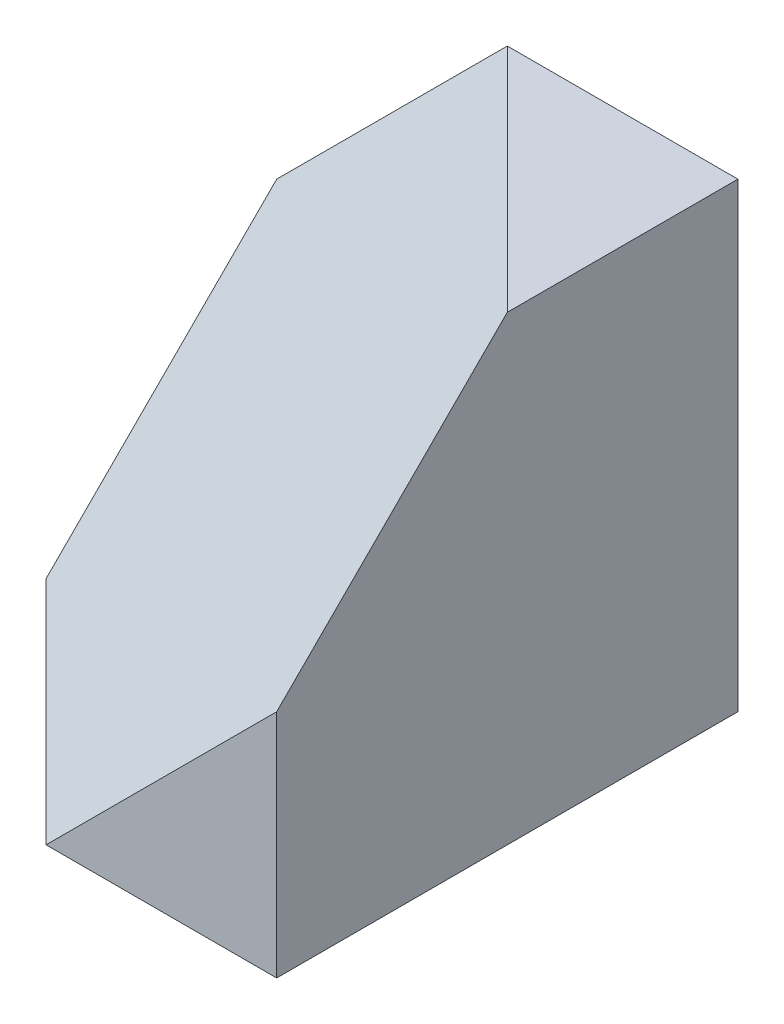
ISO-10303-21;
HEADER;
FILE_DESCRIPTION(('STEP AP214'),'2;1');
FILE_NAME('part.step','',(''),(''),'','','');
FILE_SCHEMA(('AUTOMOTIVE_DESIGN { 1 0 10303 214 1 1 1 1 }'));
ENDSEC;
DATA;
#1=APPLICATION_CONTEXT('core data for automotive mechanical design processes');
#2=APPLICATION_PROTOCOL_DEFINITION('international standard','automotive_design',2000,#1);
#3=PRODUCT_CONTEXT('',#1,'mechanical');
#4=PRODUCT('Part','Part','',(#3));
#5=PRODUCT_RELATED_PRODUCT_CATEGORY('part','',(#4));
#6=PRODUCT_DEFINITION_FORMATION('','',#4);
#7=PRODUCT_DEFINITION_CONTEXT('part definition',#1,'design');
#8=PRODUCT_DEFINITION('design','',#6,#7);
#9=PRODUCT_DEFINITION_SHAPE('','',#8);
#10=(LENGTH_UNIT() NAMED_UNIT(*) SI_UNIT(.MILLI.,.METRE.));
#11=(NAMED_UNIT(*) PLANE_ANGLE_UNIT() SI_UNIT($,.RADIAN.));
#12=(NAMED_UNIT(*) SI_UNIT($,.STERADIAN.) SOLID_ANGLE_UNIT());
#13=UNCERTAINTY_MEASURE_WITH_UNIT(LENGTH_MEASURE(1.E-05),#10,'distance_accuracy_value','');
#14=(GEOMETRIC_REPRESENTATION_CONTEXT(3) GLOBAL_UNCERTAINTY_ASSIGNED_CONTEXT((#13)) GLOBAL_UNIT_ASSIGNED_CONTEXT((#10,
#11,#12)) REPRESENTATION_CONTEXT('',''));
#15=CARTESIAN_POINT('',(0.,0.,0.));
#16=DIRECTION('',(0.,0.,1.));
#17=DIRECTION('',(1.,0.,0.));
#18=AXIS2_PLACEMENT_3D('',#15,#16,#17);
#19=CARTESIAN_POINT('',(0.,0.,-10.));
#20=DIRECTION('',(-1.,0.,0.));
#21=DIRECTION('',(0.,0.,1.));
#22=AXIS2_PLACEMENT_3D('',#19,#20,#21);
#23=PLANE('',#22);
#24=DIRECTION('',(0.,-0.707106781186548,0.707106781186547));
#25=VECTOR('',#24,1.);
#26=CARTESIAN_POINT('',(0.,2.5,-7.5));
#27=LINE('',#26,#25);
#28=CARTESIAN_POINT('',(0.,5.,-10.));
#29=VERTEX_POINT('',#28);
#30=CARTESIAN_POINT('',(0.,0.,-5.));
#31=VERTEX_POINT('',#30);
#32=EDGE_CURVE('E118',#29,#31,#27,.T.);
#33=ORIENTED_EDGE('',*,*,#32,.F.);
#34=DIRECTION('',(0.,-1.,0.));
#35=VECTOR('',#34,1.);
#36=CARTESIAN_POINT('',(0.,0.,-10.));
#37=LINE('',#36,#35);
#38=CARTESIAN_POINT('',(0.,0.,-10.));
#39=VERTEX_POINT('',#38);
#40=EDGE_CURVE('E97',#29,#39,#37,.T.);
#41=ORIENTED_EDGE('',*,*,#40,.T.);
#42=DIRECTION('',(0.,0.,1.));
#43=VECTOR('',#42,1.);
#44=CARTESIAN_POINT('',(0.,0.,-10.));
#45=LINE('',#44,#43);
#46=EDGE_CURVE('E106',#39,#31,#45,.T.);
#47=ORIENTED_EDGE('',*,*,#46,.T.);
#48=EDGE_LOOP('',(#33,#41,#47));
#49=FACE_BOUND('',#48,.T.);
#50=ADVANCED_FACE('F36',(#49),#23,.T.);
#51=CARTESIAN_POINT('',(0.,10.,-10.));
#52=DIRECTION('',(0.,1.,0.));
#53=DIRECTION('',(0.,0.,1.));
#54=AXIS2_PLACEMENT_3D('',#51,#52,#53);
#55=PLANE('',#54);
#56=DIRECTION('',(-0.707106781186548,0.,-0.707106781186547));
#57=VECTOR('',#56,1.);
#58=CARTESIAN_POINT('',(2.5,10.,-12.5));
#59=LINE('',#58,#57);
#60=CARTESIAN_POINT('',(10.,10.,-5.));
#61=VERTEX_POINT('',#60);
#62=CARTESIAN_POINT('',(5.,10.,-10.));
#63=VERTEX_POINT('',#62);
#64=EDGE_CURVE('E94',#61,#63,#59,.T.);
#65=ORIENTED_EDGE('',*,*,#64,.F.);
#66=DIRECTION('',(0.,0.,1.));
#67=VECTOR('',#66,1.);
#68=CARTESIAN_POINT('',(10.,10.,-10.));
#69=LINE('',#68,#67);
#70=CARTESIAN_POINT('',(10.,10.,-10.));
#71=VERTEX_POINT('',#70);
#72=EDGE_CURVE('E43',#71,#61,#69,.T.);
#73=ORIENTED_EDGE('',*,*,#72,.F.);
#74=DIRECTION('',(-1.,0.,0.));
#75=VECTOR('',#74,1.);
#76=CARTESIAN_POINT('',(0.,10.,-10.));
#77=LINE('',#76,#75);
#78=EDGE_CURVE('E108',#71,#63,#77,.T.);
#79=ORIENTED_EDGE('',*,*,#78,.T.);
#80=EDGE_LOOP('',(#65,#73,#79));
#81=FACE_BOUND('',#80,.T.);
#82=ADVANCED_FACE('F134',(#81),#55,.T.);
#83=CARTESIAN_POINT('',(10.,0.,-10.));
#84=DIRECTION('',(1.,0.,0.));
#85=DIRECTION('',(0.,1.,0.));
#86=AXIS2_PLACEMENT_3D('',#83,#84,#85);
#87=PLANE('',#86);
#88=DIRECTION('',(0.,0.707106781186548,-0.707106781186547));
#89=VECTOR('',#88,1.);
#90=CARTESIAN_POINT('',(10.,7.5,-2.5));
#91=LINE('',#90,#89);
#92=CARTESIAN_POINT('',(10.,5.,0.));
#93=VERTEX_POINT('',#92);
#94=EDGE_CURVE('E89',#93,#61,#91,.T.);
#95=ORIENTED_EDGE('',*,*,#94,.F.);
#96=DIRECTION('',(0.,1.,0.));
#97=VECTOR('',#96,1.);
#98=CARTESIAN_POINT('',(10.,0.,0.));
#99=LINE('',#98,#97);
#100=CARTESIAN_POINT('',(10.,0.,0.));
#101=VERTEX_POINT('',#100);
#102=EDGE_CURVE('E93',#101,#93,#99,.T.);
#103=ORIENTED_EDGE('',*,*,#102,.F.);
#104=DIRECTION('',(0.,0.,1.));
#105=VECTOR('',#104,1.);
#106=CARTESIAN_POINT('',(10.,0.,-10.));
#107=LINE('',#106,#105);
#108=CARTESIAN_POINT('',(10.,0.,-10.));
#109=VERTEX_POINT('',#108);
#110=EDGE_CURVE('E105',#109,#101,#107,.T.);
#111=ORIENTED_EDGE('',*,*,#110,.F.);
#112=DIRECTION('',(0.,1.,0.));
#113=VECTOR('',#112,1.);
#114=CARTESIAN_POINT('',(10.,0.,-10.));
#115=LINE('',#114,#113);
#116=EDGE_CURVE('E111',#109,#71,#115,.T.);
#117=ORIENTED_EDGE('',*,*,#116,.T.);
#118=ORIENTED_EDGE('',*,*,#72,.T.);
#119=EDGE_LOOP('',(#95,#103,#111,#117,#118));
#120=FACE_BOUND('',#119,.T.);
#121=ADVANCED_FACE('F92',(#120),#87,.T.);
#122=CARTESIAN_POINT('',(0.,0.,-10.));
#123=DIRECTION('',(0.,-1.,0.));
#124=DIRECTION('',(0.,0.,-1.));
#125=AXIS2_PLACEMENT_3D('',#122,#123,#124);
#126=PLANE('',#125);
#127=DIRECTION('',(0.707106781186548,0.,0.707106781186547));
#128=VECTOR('',#127,1.);
#129=CARTESIAN_POINT('',(-2.5,0.,-7.5));
#130=LINE('',#129,#128);
#131=CARTESIAN_POINT('',(5.,0.,0.));
#132=VERTEX_POINT('',#131);
#133=EDGE_CURVE('E50',#31,#132,#130,.T.);
#134=ORIENTED_EDGE('',*,*,#133,.F.);
#135=ORIENTED_EDGE('',*,*,#46,.F.);
#136=DIRECTION('',(1.,0.,0.));
#137=VECTOR('',#136,1.);
#138=CARTESIAN_POINT('',(0.,0.,-10.));
#139=LINE('',#138,#137);
#140=EDGE_CURVE('E99',#39,#109,#139,.T.);
#141=ORIENTED_EDGE('',*,*,#140,.T.);
#142=ORIENTED_EDGE('',*,*,#110,.T.);
#143=DIRECTION('',(1.,0.,0.));
#144=VECTOR('',#143,1.);
#145=CARTESIAN_POINT('',(0.,0.,0.));
#146=LINE('',#145,#144);
#147=EDGE_CURVE('E69',#132,#101,#146,.T.);
#148=ORIENTED_EDGE('',*,*,#147,.F.);
#149=EDGE_LOOP('',(#134,#135,#141,#142,#148));
#150=FACE_BOUND('',#149,.T.);
#151=ADVANCED_FACE('F127',(#150),#126,.T.);
#152=CARTESIAN_POINT('',(0.,0.,-10.));
#153=DIRECTION('',(0.,0.,-1.));
#154=DIRECTION('',(-1.,0.,0.));
#155=AXIS2_PLACEMENT_3D('',#152,#153,#154);
#156=PLANE('',#155);
#157=DIRECTION('',(-0.707106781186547,-0.707106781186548,0.));
#158=VECTOR('',#157,1.);
#159=CARTESIAN_POINT('',(-2.5,2.5,-10.));
#160=LINE('',#159,#158);
#161=EDGE_CURVE('E77',#63,#29,#160,.T.);
#162=ORIENTED_EDGE('',*,*,#161,.F.);
#163=ORIENTED_EDGE('',*,*,#78,.F.);
#164=ORIENTED_EDGE('',*,*,#116,.F.);
#165=ORIENTED_EDGE('',*,*,#140,.F.);
#166=ORIENTED_EDGE('',*,*,#40,.F.);
#167=EDGE_LOOP('',(#162,#163,#164,#165,#166));
#168=FACE_BOUND('',#167,.T.);
#169=ADVANCED_FACE('F123',(#168),#156,.T.);
#170=CARTESIAN_POINT('',(0.,0.,0.));
#171=DIRECTION('',(0.,0.,-1.));
#172=DIRECTION('',(-1.,0.,0.));
#173=AXIS2_PLACEMENT_3D('',#170,#171,#172);
#174=PLANE('',#173);
#175=ORIENTED_EDGE('',*,*,#102,.T.);
#176=DIRECTION('',(-0.707106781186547,-0.707106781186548,0.));
#177=VECTOR('',#176,1.);
#178=CARTESIAN_POINT('',(2.5,-2.5,0.));
#179=LINE('',#178,#177);
#180=EDGE_CURVE('E12',#93,#132,#179,.T.);
#181=ORIENTED_EDGE('',*,*,#180,.T.);
#182=ORIENTED_EDGE('',*,*,#147,.T.);
#183=EDGE_LOOP('',(#175,#181,#182));
#184=FACE_BOUND('',#183,.T.);
#185=ADVANCED_FACE('F96',(#184),#174,.F.);
#186=CARTESIAN_POINT('',(1.66666666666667,-1.66666666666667,-1.66666666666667));
#187=DIRECTION('',(0.577350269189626,-0.577350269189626,-0.577350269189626));
#188=DIRECTION('',(-0.707106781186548,0.,-0.707106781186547));
#189=AXIS2_PLACEMENT_3D('',#186,#187,#188);
#190=PLANE('',#189);
#191=ORIENTED_EDGE('',*,*,#64,.T.);
#192=ORIENTED_EDGE('',*,*,#161,.T.);
#193=ORIENTED_EDGE('',*,*,#32,.T.);
#194=ORIENTED_EDGE('',*,*,#133,.T.);
#195=ORIENTED_EDGE('',*,*,#180,.F.);
#196=ORIENTED_EDGE('',*,*,#94,.T.);
#197=EDGE_LOOP('',(#191,#192,#193,#194,#195,#196));
#198=FACE_BOUND('',#197,.T.);
#199=ADVANCED_FACE('F88',(#198),#190,.F.);
#200=CLOSED_SHELL('',(#50,#82,#121,#151,#169,#185,#199));
#201=MANIFOLD_SOLID_BREP('B2',#200);
#202=ADVANCED_BREP_SHAPE_REPRESENTATION('',(#18,#201),#14);
#203=SHAPE_DEFINITION_REPRESENTATION(#9,#202);
ENDSEC;
END-ISO-10303-21;
